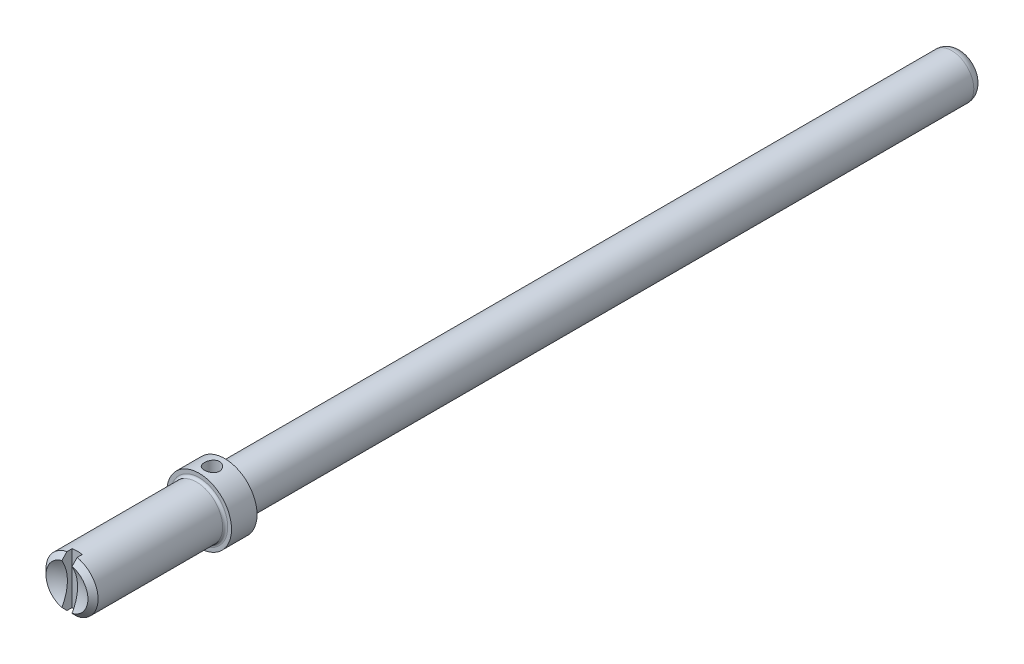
from build123d import *

# Parameters (mm, degrees)
SKETCH_2_R          = 1.1811
SKETCH_2_W          = 1.5875
SKETCH_2_H          = 1.5875
CUT_EXTRUDE_1_DEPTH = 11.43


with BuildPart() as part:
    # Sketch 1 → Revolve 1 (revolve)
    with BuildSketch(Plane(origin=(0, 0, 0), x_dir=(0, 0, -1), z_dir=(1, 0, 0)), mode=Mode.PRIVATE) as revolve_1_sk:
        with BuildLine():
            Line((138.793157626, 0), (0, 0))
            ThreePointArc((0, 0), (-0.230908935, 1.696827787), (-0.906842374, 3.27025))
            Line((-0.906842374, 3.27025), (-0.113092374, 4.064))
            Line((-0.113092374, 4.064), (19.333782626, 4.064))
            ThreePointArc((19.333782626, 4.064), (19.614415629, 4.180241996), (19.730657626, 4.460875))
            Line((19.730657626, 4.460875), (19.730657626, 5.0546))
            Line((19.730657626, 5.0546), (23.718457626, 5.0546))
            Line((23.718457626, 5.0546), (23.718457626, 3.851275))
            ThreePointArc((23.718457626, 3.851275), (23.834699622, 3.570641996), (24.115332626, 3.4544))
            Line((24.115332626, 3.4544), (137.205657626, 3.4544))
            ThreePointArc((137.205657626, 3.4544), (138.328189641, 2.989432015), (138.793157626, 1.8669))
            Line((138.793157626, 1.8669), (138.793157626, 0))
        make_face()
    revolve(revolve_1_sk.sketch.rotate(Axis((0, 0, 11.687365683), (0, 0, -1)), 90), axis=Axis((0, 0, 11.687365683), (0, 0, -1)))

    # Sketch 2 → Cut-Extrude 1 (cut, symmetric)
    with BuildSketch(Plane(origin=(0, 0, 0), x_dir=(1, 0, 0), z_dir=(0, 1, 0))):
        with Locations(Location((0, 21.724557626, 0), (0, 0, 270))):
            Circle(SKETCH_2_R)
        with Locations((0, -0.113092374)):
            Rectangle(SKETCH_2_W, SKETCH_2_H)
    extrude(amount=CUT_EXTRUDE_1_DEPTH, both=True, mode=Mode.SUBTRACT)


solid = part.part
